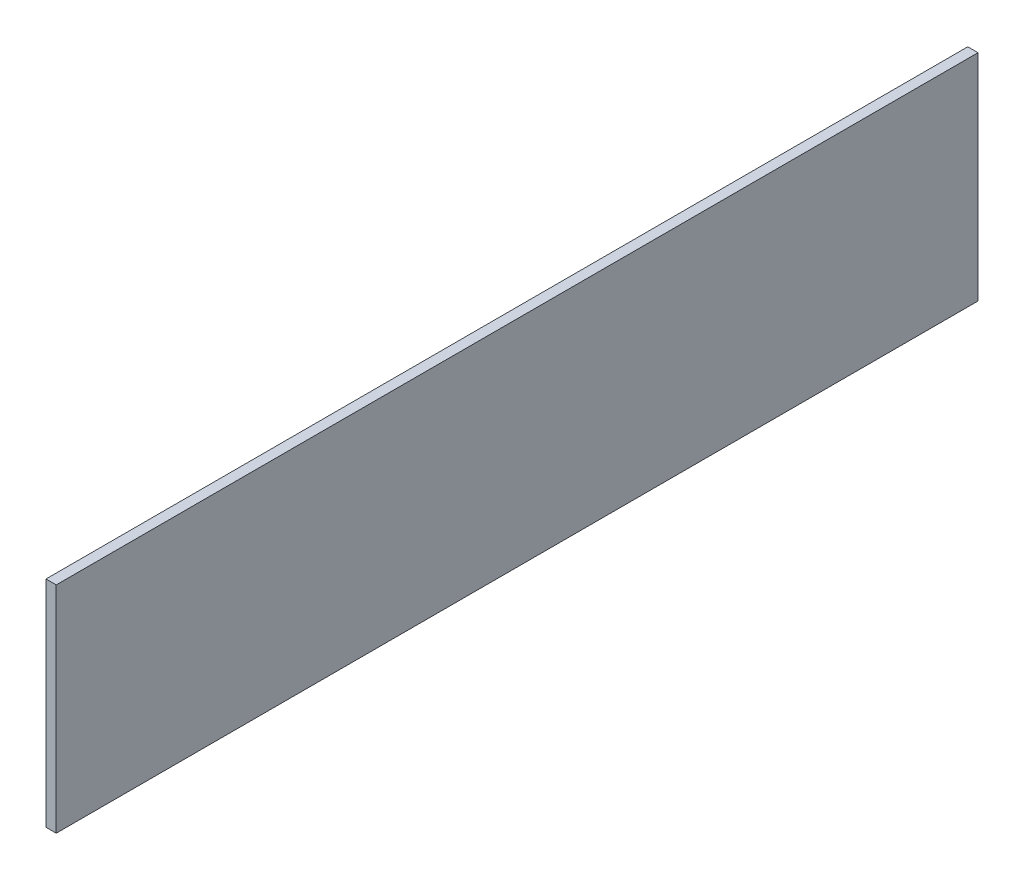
ISO-10303-21;
HEADER;
FILE_DESCRIPTION(('STEP AP214'),'2;1');
FILE_NAME('part.step','',(''),(''),'','','');
FILE_SCHEMA(('AUTOMOTIVE_DESIGN { 1 0 10303 214 1 1 1 1 }'));
ENDSEC;
DATA;
#1=APPLICATION_CONTEXT('core data for automotive mechanical design processes');
#2=APPLICATION_PROTOCOL_DEFINITION('international standard','automotive_design',2000,#1);
#3=PRODUCT_CONTEXT('',#1,'mechanical');
#4=PRODUCT('Part','Part','',(#3));
#5=PRODUCT_RELATED_PRODUCT_CATEGORY('part','',(#4));
#6=PRODUCT_DEFINITION_FORMATION('','',#4);
#7=PRODUCT_DEFINITION_CONTEXT('part definition',#1,'design');
#8=PRODUCT_DEFINITION('design','',#6,#7);
#9=PRODUCT_DEFINITION_SHAPE('','',#8);
#10=(LENGTH_UNIT() NAMED_UNIT(*) SI_UNIT(.MILLI.,.METRE.));
#11=(NAMED_UNIT(*) PLANE_ANGLE_UNIT() SI_UNIT($,.RADIAN.));
#12=(NAMED_UNIT(*) SI_UNIT($,.STERADIAN.) SOLID_ANGLE_UNIT());
#13=UNCERTAINTY_MEASURE_WITH_UNIT(LENGTH_MEASURE(1.E-05),#10,'distance_accuracy_value','');
#14=(GEOMETRIC_REPRESENTATION_CONTEXT(3) GLOBAL_UNCERTAINTY_ASSIGNED_CONTEXT((#13)) GLOBAL_UNIT_ASSIGNED_CONTEXT((#10,
#11,#12)) REPRESENTATION_CONTEXT('',''));
#15=CARTESIAN_POINT('',(0.,0.,0.));
#16=DIRECTION('',(0.,0.,1.));
#17=DIRECTION('',(1.,0.,0.));
#18=AXIS2_PLACEMENT_3D('',#15,#16,#17);
#19=CARTESIAN_POINT('',(3.175,0.,0.));
#20=DIRECTION('',(0.,0.,-1.));
#21=DIRECTION('',(-1.,0.,0.));
#22=AXIS2_PLACEMENT_3D('',#19,#20,#21);
#23=PLANE('',#22);
#24=DIRECTION('',(0.,-1.,0.));
#25=VECTOR('',#24,1.);
#26=CARTESIAN_POINT('',(0.,0.,0.));
#27=LINE('',#26,#25);
#28=CARTESIAN_POINT('',(0.,66.675,0.));
#29=VERTEX_POINT('',#28);
#30=CARTESIAN_POINT('',(0.,0.,0.));
#31=VERTEX_POINT('',#30);
#32=EDGE_CURVE('E94',#29,#31,#27,.T.);
#33=ORIENTED_EDGE('',*,*,#32,.T.);
#34=DIRECTION('',(-1.,0.,0.));
#35=VECTOR('',#34,1.);
#36=CARTESIAN_POINT('',(3.175,0.,0.));
#37=LINE('',#36,#35);
#38=CARTESIAN_POINT('',(3.175,0.,0.));
#39=VERTEX_POINT('',#38);
#40=EDGE_CURVE('E11',#39,#31,#37,.T.);
#41=ORIENTED_EDGE('',*,*,#40,.F.);
#42=DIRECTION('',(0.,-1.,0.));
#43=VECTOR('',#42,1.);
#44=CARTESIAN_POINT('',(3.175,0.,0.));
#45=LINE('',#44,#43);
#46=CARTESIAN_POINT('',(3.175,66.675,0.));
#47=VERTEX_POINT('',#46);
#48=EDGE_CURVE('E82',#47,#39,#45,.T.);
#49=ORIENTED_EDGE('',*,*,#48,.F.);
#50=DIRECTION('',(-1.,0.,0.));
#51=VECTOR('',#50,1.);
#52=CARTESIAN_POINT('',(3.175,66.675,0.));
#53=LINE('',#52,#51);
#54=EDGE_CURVE('E90',#47,#29,#53,.T.);
#55=ORIENTED_EDGE('',*,*,#54,.T.);
#56=EDGE_LOOP('',(#33,#41,#49,#55));
#57=FACE_BOUND('',#56,.T.);
#58=ADVANCED_FACE('F31',(#57),#23,.F.);
#59=CARTESIAN_POINT('',(3.175,0.,0.));
#60=DIRECTION('',(0.,1.,0.));
#61=DIRECTION('',(0.,0.,1.));
#62=AXIS2_PLACEMENT_3D('',#59,#60,#61);
#63=PLANE('',#62);
#64=DIRECTION('',(0.,0.,-1.));
#65=VECTOR('',#64,1.);
#66=CARTESIAN_POINT('',(0.,0.,0.));
#67=LINE('',#66,#65);
#68=CARTESIAN_POINT('',(0.,0.,-285.75));
#69=VERTEX_POINT('',#68);
#70=EDGE_CURVE('E86',#31,#69,#67,.T.);
#71=ORIENTED_EDGE('',*,*,#70,.T.);
#72=DIRECTION('',(-1.,0.,0.));
#73=VECTOR('',#72,1.);
#74=CARTESIAN_POINT('',(3.175,0.,-285.75));
#75=LINE('',#74,#73);
#76=CARTESIAN_POINT('',(3.175,0.,-285.75));
#77=VERTEX_POINT('',#76);
#78=EDGE_CURVE('E39',#77,#69,#75,.T.);
#79=ORIENTED_EDGE('',*,*,#78,.F.);
#80=DIRECTION('',(0.,0.,-1.));
#81=VECTOR('',#80,1.);
#82=CARTESIAN_POINT('',(3.175,0.,0.));
#83=LINE('',#82,#81);
#84=EDGE_CURVE('E77',#39,#77,#83,.T.);
#85=ORIENTED_EDGE('',*,*,#84,.F.);
#86=ORIENTED_EDGE('',*,*,#40,.T.);
#87=EDGE_LOOP('',(#71,#79,#85,#86));
#88=FACE_BOUND('',#87,.T.);
#89=ADVANCED_FACE('F85',(#88),#63,.F.);
#90=CARTESIAN_POINT('',(3.175,0.,-285.75));
#91=DIRECTION('',(0.,0.,1.));
#92=DIRECTION('',(1.,0.,0.));
#93=AXIS2_PLACEMENT_3D('',#90,#91,#92);
#94=PLANE('',#93);
#95=DIRECTION('',(0.,1.,0.));
#96=VECTOR('',#95,1.);
#97=CARTESIAN_POINT('',(0.,0.,-285.75));
#98=LINE('',#97,#96);
#99=CARTESIAN_POINT('',(0.,66.675,-285.75));
#100=VERTEX_POINT('',#99);
#101=EDGE_CURVE('E64',#69,#100,#98,.T.);
#102=ORIENTED_EDGE('',*,*,#101,.T.);
#103=DIRECTION('',(-1.,0.,0.));
#104=VECTOR('',#103,1.);
#105=CARTESIAN_POINT('',(3.175,66.675,-285.75));
#106=LINE('',#105,#104);
#107=CARTESIAN_POINT('',(3.175,66.675,-285.75));
#108=VERTEX_POINT('',#107);
#109=EDGE_CURVE('E87',#108,#100,#106,.T.);
#110=ORIENTED_EDGE('',*,*,#109,.F.);
#111=DIRECTION('',(0.,1.,0.));
#112=VECTOR('',#111,1.);
#113=CARTESIAN_POINT('',(3.175,0.,-285.75));
#114=LINE('',#113,#112);
#115=EDGE_CURVE('E80',#77,#108,#114,.T.);
#116=ORIENTED_EDGE('',*,*,#115,.F.);
#117=ORIENTED_EDGE('',*,*,#78,.T.);
#118=EDGE_LOOP('',(#102,#110,#116,#117));
#119=FACE_BOUND('',#118,.T.);
#120=ADVANCED_FACE('F88',(#119),#94,.F.);
#121=CARTESIAN_POINT('',(3.175,66.675,0.));
#122=DIRECTION('',(0.,-1.,0.));
#123=DIRECTION('',(0.,0.,-1.));
#124=AXIS2_PLACEMENT_3D('',#121,#122,#123);
#125=PLANE('',#124);
#126=DIRECTION('',(0.,0.,1.));
#127=VECTOR('',#126,1.);
#128=CARTESIAN_POINT('',(0.,66.675,0.));
#129=LINE('',#128,#127);
#130=EDGE_CURVE('E70',#100,#29,#129,.T.);
#131=ORIENTED_EDGE('',*,*,#130,.T.);
#132=ORIENTED_EDGE('',*,*,#54,.F.);
#133=DIRECTION('',(0.,0.,1.));
#134=VECTOR('',#133,1.);
#135=CARTESIAN_POINT('',(3.175,66.675,0.));
#136=LINE('',#135,#134);
#137=EDGE_CURVE('E47',#108,#47,#136,.T.);
#138=ORIENTED_EDGE('',*,*,#137,.F.);
#139=ORIENTED_EDGE('',*,*,#109,.T.);
#140=EDGE_LOOP('',(#131,#132,#138,#139));
#141=FACE_BOUND('',#140,.T.);
#142=ADVANCED_FACE('F101',(#141),#125,.F.);
#143=CARTESIAN_POINT('',(3.175,66.675,0.));
#144=DIRECTION('',(-1.,0.,0.));
#145=DIRECTION('',(0.,0.,1.));
#146=AXIS2_PLACEMENT_3D('',#143,#144,#145);
#147=PLANE('',#146);
#148=ORIENTED_EDGE('',*,*,#48,.T.);
#149=ORIENTED_EDGE('',*,*,#84,.T.);
#150=ORIENTED_EDGE('',*,*,#115,.T.);
#151=ORIENTED_EDGE('',*,*,#137,.T.);
#152=EDGE_LOOP('',(#148,#149,#150,#151));
#153=FACE_BOUND('',#152,.T.);
#154=ADVANCED_FACE('F78',(#153),#147,.F.);
#155=CARTESIAN_POINT('',(0.,66.675,0.));
#156=DIRECTION('',(-1.,0.,0.));
#157=DIRECTION('',(0.,0.,1.));
#158=AXIS2_PLACEMENT_3D('',#155,#156,#157);
#159=PLANE('',#158);
#160=ORIENTED_EDGE('',*,*,#32,.F.);
#161=ORIENTED_EDGE('',*,*,#130,.F.);
#162=ORIENTED_EDGE('',*,*,#101,.F.);
#163=ORIENTED_EDGE('',*,*,#70,.F.);
#164=EDGE_LOOP('',(#160,#161,#162,#163));
#165=FACE_BOUND('',#164,.T.);
#166=ADVANCED_FACE('F104',(#165),#159,.T.);
#167=CLOSED_SHELL('',(#58,#89,#120,#142,#154,#166));
#168=MANIFOLD_SOLID_BREP('B2',#167);
#169=ADVANCED_BREP_SHAPE_REPRESENTATION('',(#18,#168),#14);
#170=SHAPE_DEFINITION_REPRESENTATION(#9,#169);
ENDSEC;
END-ISO-10303-21;
